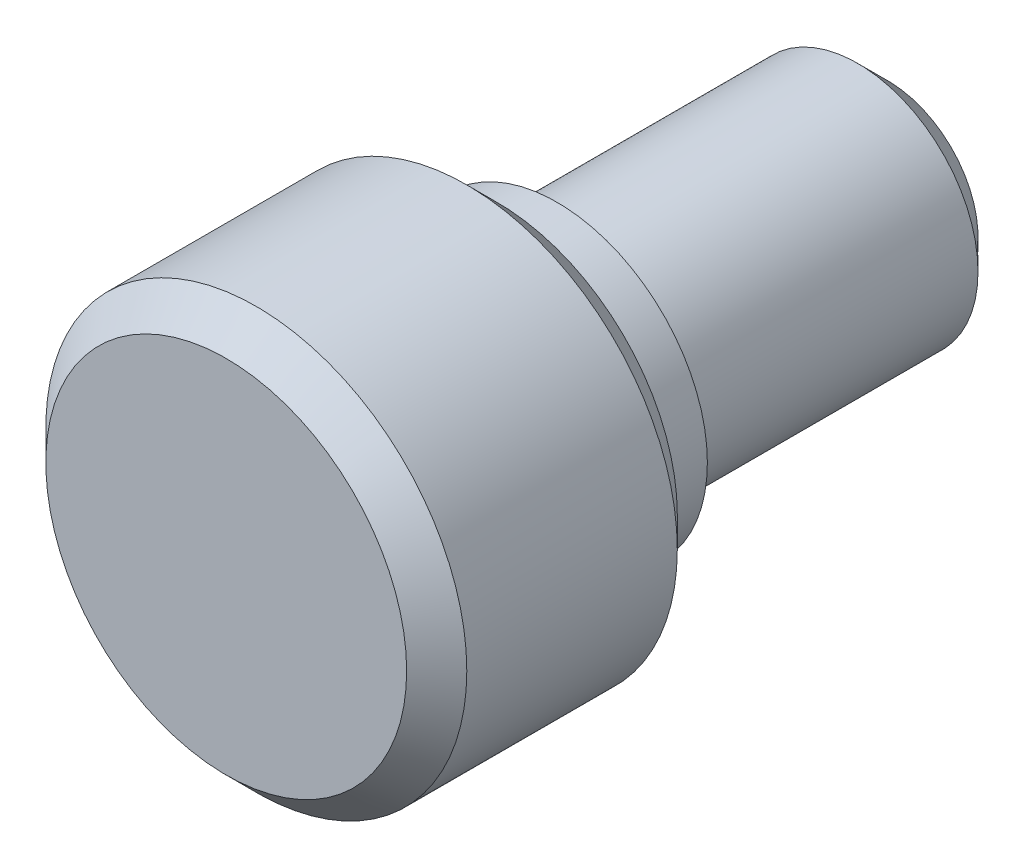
from build123d import *

# Parameters (mm, degrees)
ESQUISSE1_R          = 7
BASE_EXTRUSION_DEPTH = 9
CHANFREIN1_SIZE      = 1
ESQUISSE2_R          = 5
BOSS_EXTRU_1_DEPTH   = 2
ESQUISSE3_R          = 4
BOSS_EXTRU_2_DEPTH   = 11
CHANFREIN2_SIZE      = 1


with BuildPart() as part:
    # Esquisse1 → Base-Extrusion (new body)
    with BuildSketch(Plane.XY):
        Circle(ESQUISSE1_R)
    extrude(amount=BASE_EXTRUSION_DEPTH)

    # Chanfrein1
    chanfrein1_edges = [part.edges().sort_by_distance(p)[0] for p in [
        (-7, 0, 0),
        (-7, 0, 9),
    ]]
    chamfer(chanfrein1_edges, length=CHANFREIN1_SIZE)

    # Esquisse2 → Boss.-Extru.1 (add)
    with BuildSketch(Plane(origin=(0, 0, 0), x_dir=(-1, 0, 0), z_dir=(0, 0, -1))):
        with Locations(Location((0, 0, 0), (0, 0, 180))):
            Circle(ESQUISSE2_R)
    extrude(amount=BOSS_EXTRU_1_DEPTH)

    # Esquisse3 → Boss.-Extru.2 (add)
    with BuildSketch(Plane(origin=(0, 0, -2), x_dir=(-1, 0, 0), z_dir=(0, 0, -1))):
        Circle(ESQUISSE3_R)
    extrude(amount=BOSS_EXTRU_2_DEPTH)

    # Chanfrein2
    chanfrein2_edges = [part.edges().sort_by_distance(p)[0] for p in [
        (4, 0, -13),
    ]]
    chamfer(chanfrein2_edges, length=CHANFREIN2_SIZE)


solid = part.part
